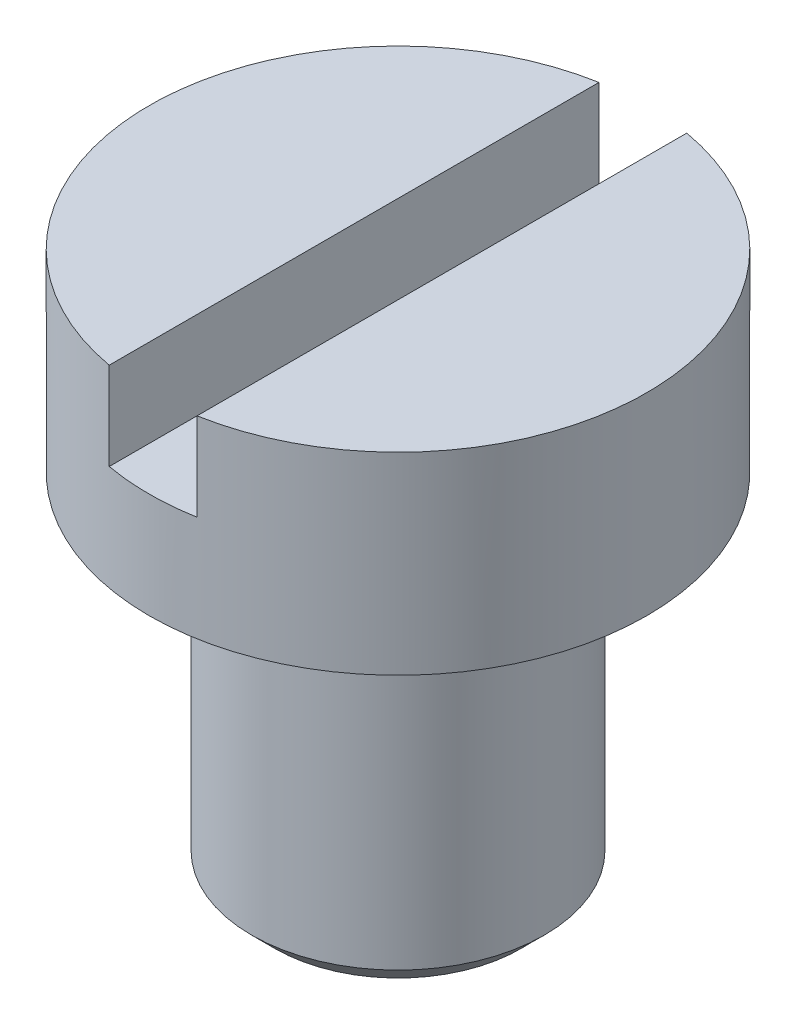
ISO-10303-21;
HEADER;
FILE_DESCRIPTION(('STEP AP214'),'2;1');
FILE_NAME('part.step','',(''),(''),'','','');
FILE_SCHEMA(('AUTOMOTIVE_DESIGN { 1 0 10303 214 1 1 1 1 }'));
ENDSEC;
DATA;
#1=APPLICATION_CONTEXT('core data for automotive mechanical design processes');
#2=APPLICATION_PROTOCOL_DEFINITION('international standard','automotive_design',2000,#1);
#3=PRODUCT_CONTEXT('',#1,'mechanical');
#4=PRODUCT('Part','Part','',(#3));
#5=PRODUCT_RELATED_PRODUCT_CATEGORY('part','',(#4));
#6=PRODUCT_DEFINITION_FORMATION('','',#4);
#7=PRODUCT_DEFINITION_CONTEXT('part definition',#1,'design');
#8=PRODUCT_DEFINITION('design','',#6,#7);
#9=PRODUCT_DEFINITION_SHAPE('','',#8);
#10=(LENGTH_UNIT() NAMED_UNIT(*) SI_UNIT(.MILLI.,.METRE.));
#11=(NAMED_UNIT(*) PLANE_ANGLE_UNIT() SI_UNIT($,.RADIAN.));
#12=(NAMED_UNIT(*) SI_UNIT($,.STERADIAN.) SOLID_ANGLE_UNIT());
#13=UNCERTAINTY_MEASURE_WITH_UNIT(LENGTH_MEASURE(1.E-05),#10,'distance_accuracy_value','');
#14=(GEOMETRIC_REPRESENTATION_CONTEXT(3) GLOBAL_UNCERTAINTY_ASSIGNED_CONTEXT((#13)) GLOBAL_UNIT_ASSIGNED_CONTEXT((#10,
#11,#12)) REPRESENTATION_CONTEXT('',''));
#15=CARTESIAN_POINT('',(0.,0.,0.));
#16=DIRECTION('',(0.,0.,1.));
#17=DIRECTION('',(1.,0.,0.));
#18=AXIS2_PLACEMENT_3D('',#15,#16,#17);
#19=CARTESIAN_POINT('',(0.,18.6,0.));
#20=DIRECTION('',(0.,-1.,0.));
#21=DIRECTION('',(0.,0.,-1.));
#22=AXIS2_PLACEMENT_3D('',#19,#20,#21);
#23=PLANE('',#22);
#24=CARTESIAN_POINT('',(0.,18.6,0.));
#25=DIRECTION('',(0.,-1.,0.));
#26=DIRECTION('',(0.,0.,-1.));
#27=AXIS2_PLACEMENT_3D('',#24,#25,#26);
#28=CIRCLE('',#27,8.5);
#29=CARTESIAN_POINT('',(1.5,18.6,-8.36660026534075));
#30=VERTEX_POINT('',#29);
#31=CARTESIAN_POINT('',(1.5,18.6,8.36660026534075));
#32=VERTEX_POINT('',#31);
#33=EDGE_CURVE('E401',#30,#32,#28,.T.);
#34=ORIENTED_EDGE('',*,*,#33,.F.);
#35=DIRECTION('',(0.,0.,1.));
#36=VECTOR('',#35,1.);
#37=CARTESIAN_POINT('',(1.5,18.6,0.));
#38=LINE('',#37,#36);
#39=EDGE_CURVE('E442',#30,#32,#38,.T.);
#40=ORIENTED_EDGE('',*,*,#39,.T.);
#41=EDGE_LOOP('',(#34,#40));
#42=FACE_BOUND('',#41,.T.);
#43=ADVANCED_FACE('F348',(#42),#23,.F.);
#44=CARTESIAN_POINT('',(-1.50000000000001,18.6,8.36660026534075));
#45=VERTEX_POINT('',#44);
#46=CARTESIAN_POINT('',(-1.5,18.6,-8.36660026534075));
#47=VERTEX_POINT('',#46);
#48=EDGE_CURVE('E410',#45,#47,#28,.T.);
#49=ORIENTED_EDGE('',*,*,#48,.F.);
#50=DIRECTION('',(0.,0.,-1.));
#51=VECTOR('',#50,1.);
#52=CARTESIAN_POINT('',(-1.5,18.6,0.));
#53=LINE('',#52,#51);
#54=EDGE_CURVE('E363',#45,#47,#53,.T.);
#55=ORIENTED_EDGE('',*,*,#54,.T.);
#56=EDGE_LOOP('',(#49,#55));
#57=FACE_BOUND('',#56,.T.);
#58=ADVANCED_FACE('F350',(#57),#23,.F.);
#59=CARTESIAN_POINT('',(0.,-40.7140255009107,0.));
#60=DIRECTION('',(0.,-1.,0.));
#61=DIRECTION('',(0.,0.,-1.));
#62=AXIS2_PLACEMENT_3D('',#59,#60,#61);
#63=CYLINDRICAL_SURFACE('',#62,8.5);
#64=CARTESIAN_POINT('',(0.,12.,0.));
#65=DIRECTION('',(0.,-1.,0.));
#66=DIRECTION('',(0.,0.,-1.));
#67=AXIS2_PLACEMENT_3D('',#64,#65,#66);
#68=CIRCLE('',#67,8.5);
#69=CARTESIAN_POINT('',(0.,12.,-8.5));
#70=VERTEX_POINT('',#69);
#71=EDGE_CURVE('E443',#70,#70,#68,.T.);
#72=ORIENTED_EDGE('',*,*,#71,.F.);
#73=EDGE_LOOP('',(#72));
#74=FACE_BOUND('',#73,.T.);
#75=CARTESIAN_POINT('',(0.,15.6,0.));
#76=DIRECTION('',(0.,-1.,0.));
#77=DIRECTION('',(0.,0.,-1.));
#78=AXIS2_PLACEMENT_3D('',#75,#76,#77);
#79=CIRCLE('',#78,8.5);
#80=CARTESIAN_POINT('',(-1.5,15.6,-8.36660026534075));
#81=VERTEX_POINT('',#80);
#82=CARTESIAN_POINT('',(1.5,15.6,-8.36660026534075));
#83=VERTEX_POINT('',#82);
#84=EDGE_CURVE('E390',#81,#83,#79,.T.);
#85=ORIENTED_EDGE('',*,*,#84,.T.);
#86=DIRECTION('',(0.,-1.,0.));
#87=VECTOR('',#86,1.);
#88=CARTESIAN_POINT('',(1.5,-40.7140255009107,-8.36660026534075));
#89=LINE('',#88,#87);
#90=EDGE_CURVE('E416',#83,#30,#89,.F.);
#91=ORIENTED_EDGE('',*,*,#90,.T.);
#92=ORIENTED_EDGE('',*,*,#33,.T.);
#93=DIRECTION('',(0.,-1.,0.));
#94=VECTOR('',#93,1.);
#95=CARTESIAN_POINT('',(1.5,-40.7140255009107,8.36660026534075));
#96=LINE('',#95,#94);
#97=CARTESIAN_POINT('',(1.5,15.6,8.36660026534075));
#98=VERTEX_POINT('',#97);
#99=EDGE_CURVE('E371',#32,#98,#96,.T.);
#100=ORIENTED_EDGE('',*,*,#99,.T.);
#101=CARTESIAN_POINT('',(-1.5,15.6,8.36660026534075));
#102=VERTEX_POINT('',#101);
#103=EDGE_CURVE('E403',#98,#102,#79,.T.);
#104=ORIENTED_EDGE('',*,*,#103,.T.);
#105=DIRECTION('',(0.,-1.,0.));
#106=VECTOR('',#105,1.);
#107=CARTESIAN_POINT('',(-1.50000000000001,-40.7140255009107,8.36660026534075));
#108=LINE('',#107,#106);
#109=EDGE_CURVE('E405',#102,#45,#108,.F.);
#110=ORIENTED_EDGE('',*,*,#109,.T.);
#111=ORIENTED_EDGE('',*,*,#48,.T.);
#112=DIRECTION('',(0.,-1.,0.));
#113=VECTOR('',#112,1.);
#114=CARTESIAN_POINT('',(-1.50000000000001,-40.7140255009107,-8.36660026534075));
#115=LINE('',#114,#113);
#116=EDGE_CURVE('E400',#47,#81,#115,.T.);
#117=ORIENTED_EDGE('',*,*,#116,.T.);
#118=EDGE_LOOP('',(#85,#91,#92,#100,#104,#110,#111,#117));
#119=FACE_BOUND('',#118,.T.);
#120=ADVANCED_FACE('F408',(#74,#119),#63,.T.);
#121=CARTESIAN_POINT('',(8.5,12.,0.));
#122=DIRECTION('',(0.,1.,0.));
#123=DIRECTION('',(0.,0.,1.));
#124=AXIS2_PLACEMENT_3D('',#121,#122,#123);
#125=PLANE('',#124);
#126=CARTESIAN_POINT('',(0.,12.,0.));
#127=DIRECTION('',(0.,-1.,0.));
#128=DIRECTION('',(0.,0.,-1.));
#129=AXIS2_PLACEMENT_3D('',#126,#127,#128);
#130=CIRCLE('',#129,5.);
#131=CARTESIAN_POINT('',(0.,12.,-5.));
#132=VERTEX_POINT('',#131);
#133=EDGE_CURVE('E447',#132,#132,#130,.T.);
#134=ORIENTED_EDGE('',*,*,#133,.F.);
#135=EDGE_LOOP('',(#134));
#136=FACE_BOUND('',#135,.T.);
#137=ORIENTED_EDGE('',*,*,#71,.T.);
#138=EDGE_LOOP('',(#137));
#139=FACE_BOUND('',#138,.T.);
#140=ADVANCED_FACE('F464',(#136,#139),#125,.F.);
#141=CARTESIAN_POINT('',(0.,-40.7140255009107,0.));
#142=DIRECTION('',(0.,-1.,0.));
#143=DIRECTION('',(0.,0.,-1.));
#144=AXIS2_PLACEMENT_3D('',#141,#142,#143);
#145=CYLINDRICAL_SURFACE('',#144,5.);
#146=CARTESIAN_POINT('',(0.,0.800000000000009,0.));
#147=DIRECTION('',(0.,1.,0.));
#148=DIRECTION('',(0.,0.,1.));
#149=AXIS2_PLACEMENT_3D('',#146,#147,#148);
#150=CIRCLE('',#149,5.);
#151=CARTESIAN_POINT('',(0.,0.800000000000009,5.));
#152=VERTEX_POINT('',#151);
#153=EDGE_CURVE('E11',#152,#152,#150,.T.);
#154=ORIENTED_EDGE('',*,*,#153,.T.);
#155=EDGE_LOOP('',(#154));
#156=FACE_BOUND('',#155,.T.);
#157=ORIENTED_EDGE('',*,*,#133,.T.);
#158=EDGE_LOOP('',(#157));
#159=FACE_BOUND('',#158,.T.);
#160=ADVANCED_FACE('F459',(#156,#159),#145,.T.);
#161=CARTESIAN_POINT('',(5.,0.,0.));
#162=DIRECTION('',(0.,1.,0.));
#163=DIRECTION('',(0.,0.,1.));
#164=AXIS2_PLACEMENT_3D('',#161,#162,#163);
#165=PLANE('',#164);
#166=CARTESIAN_POINT('',(0.,0.,0.));
#167=DIRECTION('',(0.,1.,0.));
#168=DIRECTION('',(0.,0.,1.));
#169=AXIS2_PLACEMENT_3D('',#166,#167,#168);
#170=CIRCLE('',#169,4.19999999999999);
#171=CARTESIAN_POINT('',(0.,0.,4.19999999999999));
#172=VERTEX_POINT('',#171);
#173=EDGE_CURVE('E356',#172,#172,#170,.F.);
#174=ORIENTED_EDGE('',*,*,#173,.T.);
#175=EDGE_LOOP('',(#174));
#176=FACE_BOUND('',#175,.T.);
#177=ADVANCED_FACE('F420',(#176),#165,.F.);
#178=CARTESIAN_POINT('',(1.5,15.6,-8.5));
#179=DIRECTION('',(1.,0.,0.));
#180=DIRECTION('',(0.,1.,0.));
#181=AXIS2_PLACEMENT_3D('',#178,#179,#180);
#182=PLANE('',#181);
#183=ORIENTED_EDGE('',*,*,#39,.F.);
#184=ORIENTED_EDGE('',*,*,#90,.F.);
#185=DIRECTION('',(0.,0.,1.));
#186=VECTOR('',#185,1.);
#187=CARTESIAN_POINT('',(1.5,15.6,-8.5));
#188=LINE('',#187,#186);
#189=EDGE_CURVE('E395',#83,#98,#188,.T.);
#190=ORIENTED_EDGE('',*,*,#189,.T.);
#191=ORIENTED_EDGE('',*,*,#99,.F.);
#192=EDGE_LOOP('',(#183,#184,#190,#191));
#193=FACE_BOUND('',#192,.T.);
#194=ADVANCED_FACE('F452',(#193),#182,.F.);
#195=CARTESIAN_POINT('',(-1.5,15.6,-8.5));
#196=DIRECTION('',(0.,-1.,0.));
#197=DIRECTION('',(0.,0.,-1.));
#198=AXIS2_PLACEMENT_3D('',#195,#196,#197);
#199=PLANE('',#198);
#200=ORIENTED_EDGE('',*,*,#189,.F.);
#201=ORIENTED_EDGE('',*,*,#84,.F.);
#202=DIRECTION('',(0.,0.,1.));
#203=VECTOR('',#202,1.);
#204=CARTESIAN_POINT('',(-1.5,15.6,-8.5));
#205=LINE('',#204,#203);
#206=EDGE_CURVE('E393',#81,#102,#205,.T.);
#207=ORIENTED_EDGE('',*,*,#206,.T.);
#208=ORIENTED_EDGE('',*,*,#103,.F.);
#209=EDGE_LOOP('',(#200,#201,#207,#208));
#210=FACE_BOUND('',#209,.T.);
#211=ADVANCED_FACE('F392',(#210),#199,.F.);
#212=CARTESIAN_POINT('',(-1.5,23.7896365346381,-8.5));
#213=DIRECTION('',(-1.,0.,0.));
#214=DIRECTION('',(0.,-1.,0.));
#215=AXIS2_PLACEMENT_3D('',#212,#213,#214);
#216=PLANE('',#215);
#217=ORIENTED_EDGE('',*,*,#54,.F.);
#218=ORIENTED_EDGE('',*,*,#109,.F.);
#219=ORIENTED_EDGE('',*,*,#206,.F.);
#220=ORIENTED_EDGE('',*,*,#116,.F.);
#221=EDGE_LOOP('',(#217,#218,#219,#220));
#222=FACE_BOUND('',#221,.T.);
#223=ADVANCED_FACE('F404',(#222),#216,.F.);
#224=CARTESIAN_POINT('',(0.,0.,0.));
#225=DIRECTION('',(0.,1.,0.));
#226=DIRECTION('',(0.,0.,1.));
#227=AXIS2_PLACEMENT_3D('',#224,#225,#226);
#228=CONICAL_SURFACE('',#227,4.19999999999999,0.785398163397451);
#229=ORIENTED_EDGE('',*,*,#153,.F.);
#230=EDGE_LOOP('',(#229));
#231=FACE_BOUND('',#230,.T.);
#232=ORIENTED_EDGE('',*,*,#173,.F.);
#233=EDGE_LOOP('',(#232));
#234=FACE_BOUND('',#233,.T.);
#235=ADVANCED_FACE('F422',(#231,#234),#228,.T.);
#236=CLOSED_SHELL('',(#43,#58,#120,#140,#160,#177,#194,#211,#223,#235));
#237=MANIFOLD_SOLID_BREP('B2',#236);
#238=ADVANCED_BREP_SHAPE_REPRESENTATION('',(#18,#237),#14);
#239=SHAPE_DEFINITION_REPRESENTATION(#9,#238);
ENDSEC;
END-ISO-10303-21;
